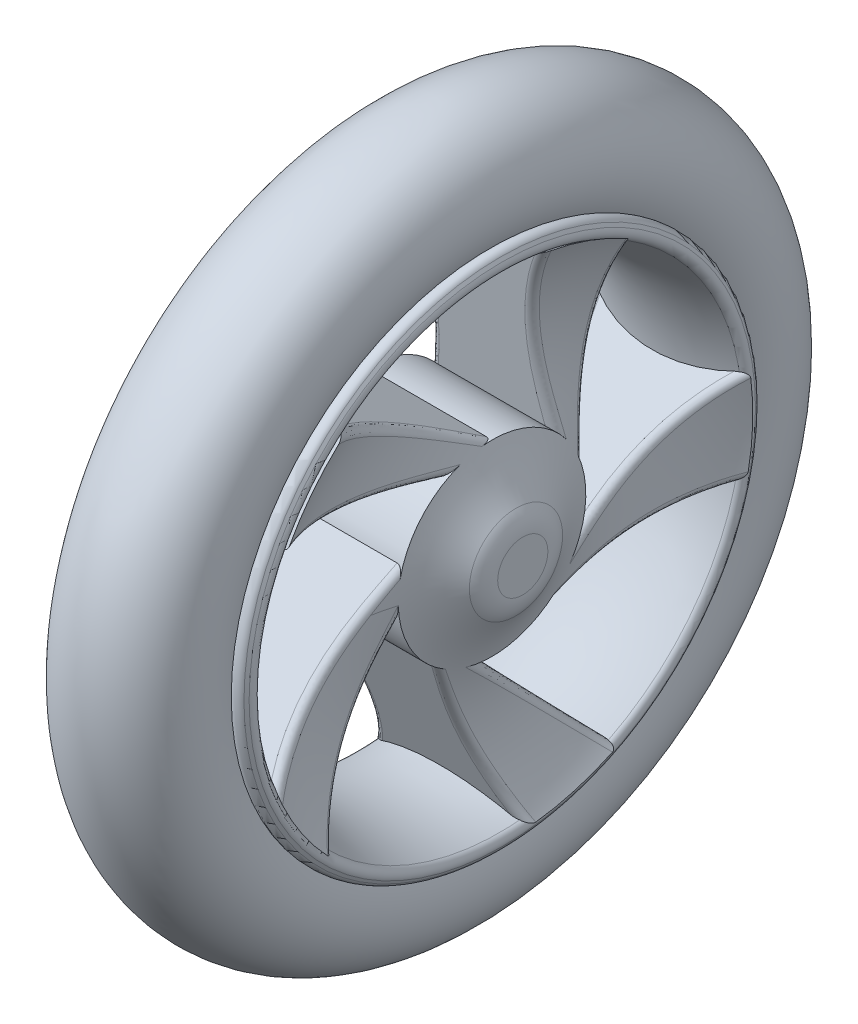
from build123d import *

# Parameters (mm, degrees)
FILLET1_R               = 2
CUT_EXTRUDE1_DEPTH      = 137.00701684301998
CUT_EXTRUDE1_DEPTH_BACK = 137.00701684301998
FILLET4_R               = 10
FILLET6_R               = 2


with BuildPart() as part:
    # Sketch1 → Revolve1 (revolve)
    with BuildSketch(Plane.XY, mode=Mode.PRIVATE) as revolve1_sk:
        with BuildLine():
            Line((-18.02775637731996, 70), (-20.60315014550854, 65.71428571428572))
            ThreePointArc((-20.60315014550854, 65.71428571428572), (-1.22e-15, 59.99999999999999), (20.60315014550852, 65.71428571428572))
            Line((20.60315014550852, 65.71428571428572), (18.02775637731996, 70))
            ThreePointArc((18.02775637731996, 70), (-1.53e-15, 65), (-18.02775637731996, 70))
        make_face()
    revolve(revolve1_sk.sketch.rotate(Axis((-55.46194086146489, 0, 0), (1, 0, 0)), 90), axis=Axis((-55.46194086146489, 0, 0), (1, 0, 0)))

    # Fillet1
    fillet1_edges = [part.edges().sort_by_distance(p)[0] for p in [
        (18.027756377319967, -1.634e-14, -70),
        (20.603150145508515, -1.534e-14, -65.71428571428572),
        (-20.603150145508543, -1.534e-14, -65.71428571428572),
        (-18.02775637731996, -1.634e-14, -70),
    ]]
    fillet(fillet1_edges, radius=FILLET1_R)

    # Sketch2 → Revolve2 (revolve)
    with BuildSketch(Plane(origin=(0, 0, 0), x_dir=(1, 0, 0), z_dir=(0, 1, 0)), mode=Mode.PRIVATE) as revolve2_sk:
        with BuildLine():
            ThreePointArc((16.379778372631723, -69.06938635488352), (-9.3e-15, -65), (-16.379778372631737, -69.06938635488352))
            ThreePointArc((-16.379778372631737, -69.06938635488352), (-1.025e-14, -94.53282125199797), (16.379778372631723, -69.06938635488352))
        make_face()
    revolve(revolve2_sk.sketch.rotate(Axis((-41.30936562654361, 0, 0), (1, 0, 0)), 180), axis=Axis((-41.30936562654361, 0, 0), (1, 0, 0)))


with BuildPart() as body_2:
    # Sketch5 → Revolve3 (revolve)
    with BuildSketch(Plane.XY, mode=Mode.PRIVATE) as revolve3_sk:
        with BuildLine():
            Line((-24.999999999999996, 10), (-25, 0))
            Line((-25, 0), (25, 0))
            Line((25, 0), (24.999999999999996, 10))
            ThreePointArc((24.999999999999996, 10), (14.290628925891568, 37.18547755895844), (20.603150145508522, 65.71428571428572))
            ThreePointArc((20.603150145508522, 65.71428571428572), (-1.899e-14, 59.99999999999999), (-20.603150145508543, 65.71428571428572))
            ThreePointArc((-20.603150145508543, 65.71428571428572), (-14.290628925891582, 37.18547755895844), (-24.999999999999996, 10))
        make_face()
    revolve(revolve3_sk.sketch.rotate(Axis((-25, 0, 0), (1, 0, 0)), 270), axis=Axis((-25, 0, 0), (1, 0, 0)))

    # Sketch3 → Cut-Extrude1 (cut, two sides: drawn at the far end of the back side and taken through both)
    with BuildSketch(Plane(origin=(0, 0, 0), x_dir=(0, 0, -1), z_dir=(1, 0, 0)).offset(-CUT_EXTRUDE1_DEPTH_BACK)):
        with BuildLine():
            Line((6.4e-16, 25.00000000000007), (-42.907475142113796, 49.77264232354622))
            ThreePointArc((-42.907475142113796, 49.77264232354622), (-18.01408506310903, 63.19699428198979), (10.216066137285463, 64.9153243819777))
            Line((10.216066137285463, 64.9153243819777), (16.72826515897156, 18.57862063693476))
            ThreePointArc((16.72826515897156, 18.57862063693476), (8.959198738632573, 23.33951066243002), (6.4e-16, 25.00000000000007))
        make_face()
        with BuildLine():
            Line((-12.499999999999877, 21.65063509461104), (-58.581204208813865, 29.775994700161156))
            ThreePointArc((-58.581204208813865, 29.775994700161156), (-65.67057164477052, 2.3965322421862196), (-60.59573481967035, -25.42684149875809))
            Line((-60.59573481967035, -25.42684149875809), (-23.776412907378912, 7.725424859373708))
            ThreePointArc((-23.776412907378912, 7.725424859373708), (-19.42864903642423, 15.733009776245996), (-12.499999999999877, 21.65063509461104))
        make_face()
        with BuildLine():
            Line((23.77641290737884, 7.725424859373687), (34.077456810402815, 56.1880261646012))
            ThreePointArc((34.077456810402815, 56.1880261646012), (54.537254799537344, 36.66135821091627), (64.89508031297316, 10.343882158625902))
            Line((64.89508031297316, 10.343882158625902), (22.838636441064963, -10.168416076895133))
            ThreePointArc((22.838636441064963, -10.168416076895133), (24.96573836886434, -1.3083989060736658), (23.77641290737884, 7.725424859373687))
        make_face()
        with BuildLine():
            Line((14.694631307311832, -20.225424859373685), (63.9685017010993, -15.046532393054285))
            ThreePointArc((63.9685017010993, -15.046532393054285), (51.71996218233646, -40.539028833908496), (29.891299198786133, -58.522453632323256))
            Line((29.891299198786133, -58.522453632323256), (-2.6132115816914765, -24.863047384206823))
            ThreePointArc((-2.6132115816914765, -24.863047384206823), (6.470476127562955, -24.148145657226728), (14.694631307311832, -20.225424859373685))
        make_face()
        with BuildLine():
            Line((-14.694631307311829, -20.22542485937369), (5.457251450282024, -65.48729459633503))
            ThreePointArc((5.457251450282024, -65.48729459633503), (-22.57256027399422, -61.71585590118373), (-46.42124144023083, -46.512747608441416))
            Line((-46.42124144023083, -46.512747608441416), (-24.45369001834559, -5.197792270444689))
            ThreePointArc((-24.45369001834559, -5.197792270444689), (-20.96676419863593, -13.615975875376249), (-14.694631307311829, -20.22542485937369))
        make_face()
    extrude(amount=CUT_EXTRUDE1_DEPTH + CUT_EXTRUDE1_DEPTH_BACK, mode=Mode.SUBTRACT)

    # Fillet4
    fillet4_edges = [body_2.edges().sort_by_distance(p)[0] for p in [
        (-25, 3.45e-15, 9.999999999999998),
        (24.999999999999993, 3.45e-15, 9.999999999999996),
    ]]
    fillet(fillet4_edges, radius=FILLET4_R)

    # Fillet6
    fillet6_edges = [body_2.edges().sort_by_distance(p)[0] for p in [
        (14.233485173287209, -26.226354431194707, 35.63477485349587),
        (14.19114203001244, -43.24627379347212, 4.445089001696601),
        (-14.191142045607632, -43.246273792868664, 4.445089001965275),
        (-14.233485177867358, -41.995074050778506, -13.930994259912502),
        (14.233485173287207, -41.995074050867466, -13.93099425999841),
        (14.191142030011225, -17.591364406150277, -39.756042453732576),
        (-14.19114204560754, -17.59136440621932, -39.756042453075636),
        (-16.066082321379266, 5.3317801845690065, -54.618748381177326),
        (16.06608232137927, 5.3317801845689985, -54.61874838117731),
        (14.19114203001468, 32.37421268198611, -29.01567449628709),
        (-14.191142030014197, 32.37421268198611, -29.01567449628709),
        (-14.233485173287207, 42.16316156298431, -13.413674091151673),
        (14.23348517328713, 42.163161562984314, -13.413674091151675),
        (14.19114203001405, 37.59972820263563, 21.82336940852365),
        (-14.191142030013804, 37.599728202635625, 21.823369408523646),
        (-14.233485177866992, 25.78629561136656, 35.95449630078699),
        (14.233485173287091, 25.786295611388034, 35.95449630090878),
        (14.191142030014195, -9.136302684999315, 42.50325853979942),
        (-14.191142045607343, -9.136302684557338, 42.50325853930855),
        (-14.233485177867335, -26.22635443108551, 35.63477485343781),
    ]]
    fillet(fillet6_edges, radius=FILLET6_R)


solid = Compound([part.part, body_2.part])
